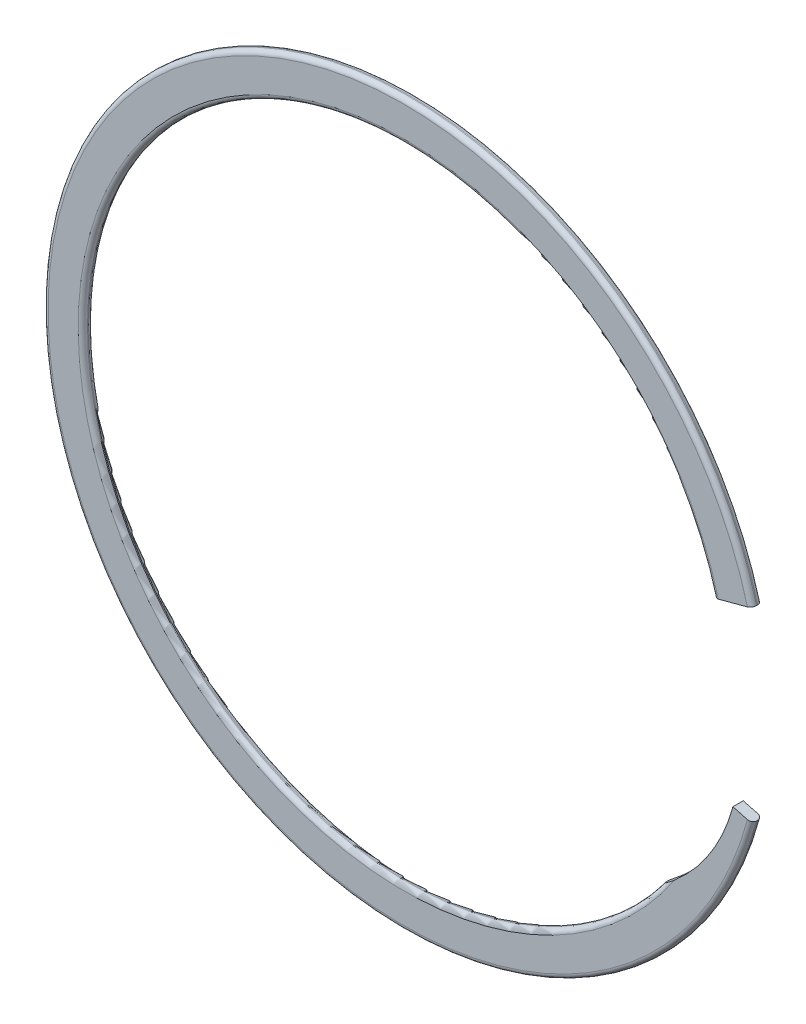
ISO-10303-21;
HEADER;
FILE_DESCRIPTION(('STEP AP214'),'2;1');
FILE_NAME('part.step','',(''),(''),'','','');
FILE_SCHEMA(('AUTOMOTIVE_DESIGN { 1 0 10303 214 1 1 1 1 }'));
ENDSEC;
DATA;
#1=APPLICATION_CONTEXT('core data for automotive mechanical design processes');
#2=APPLICATION_PROTOCOL_DEFINITION('international standard','automotive_design',2000,#1);
#3=PRODUCT_CONTEXT('',#1,'mechanical');
#4=PRODUCT('Part','Part','',(#3));
#5=PRODUCT_RELATED_PRODUCT_CATEGORY('part','',(#4));
#6=PRODUCT_DEFINITION_FORMATION('','',#4);
#7=PRODUCT_DEFINITION_CONTEXT('part definition',#1,'design');
#8=PRODUCT_DEFINITION('design','',#6,#7);
#9=PRODUCT_DEFINITION_SHAPE('','',#8);
#10=(LENGTH_UNIT() NAMED_UNIT(*) SI_UNIT(.MILLI.,.METRE.));
#11=(NAMED_UNIT(*) PLANE_ANGLE_UNIT() SI_UNIT($,.RADIAN.));
#12=(NAMED_UNIT(*) SI_UNIT($,.STERADIAN.) SOLID_ANGLE_UNIT());
#13=UNCERTAINTY_MEASURE_WITH_UNIT(LENGTH_MEASURE(1.E-05),#10,'distance_accuracy_value','');
#14=(GEOMETRIC_REPRESENTATION_CONTEXT(3) GLOBAL_UNCERTAINTY_ASSIGNED_CONTEXT((#13)) GLOBAL_UNIT_ASSIGNED_CONTEXT((#10,
#11,#12)) REPRESENTATION_CONTEXT('',''));
#15=CARTESIAN_POINT('',(0.,0.,0.));
#16=DIRECTION('',(0.,0.,1.));
#17=DIRECTION('',(1.,0.,0.));
#18=AXIS2_PLACEMENT_3D('',#15,#16,#17);
#19=CARTESIAN_POINT('',(0.,0.,0.3937));
#20=DIRECTION('',(0.,0.,-1.));
#21=DIRECTION('',(-1.,0.,0.));
#22=AXIS2_PLACEMENT_3D('',#19,#20,#21);
#23=CYLINDRICAL_SURFACE('',#22,24.4094);
#24=DIRECTION('',(0.,0.,-1.));
#25=VECTOR('',#24,1.);
#26=CARTESIAN_POINT('',(19.6264879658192,-14.512745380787,0.3937));
#27=LINE('',#26,#25);
#28=CARTESIAN_POINT('',(19.6264879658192,-14.512745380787,0.0393699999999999));
#29=VERTEX_POINT('',#28);
#30=CARTESIAN_POINT('',(19.6264879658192,-14.512745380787,-0.0393699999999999));
#31=VERTEX_POINT('',#30);
#32=EDGE_CURVE('E152',#29,#31,#27,.T.);
#33=ORIENTED_EDGE('',*,*,#32,.T.);
#34=CARTESIAN_POINT('',(0.,0.,-0.0393699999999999));
#35=DIRECTION('',(0.,0.,1.));
#36=DIRECTION('',(1.,0.,0.));
#37=AXIS2_PLACEMENT_3D('',#34,#35,#36);
#38=CIRCLE('',#37,24.4094);
#39=CARTESIAN_POINT('',(23.5776698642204,6.31761759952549,-0.0393699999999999));
#40=VERTEX_POINT('',#39);
#41=EDGE_CURVE('E188',#31,#40,#38,.F.);
#42=ORIENTED_EDGE('',*,*,#41,.T.);
#43=DIRECTION('',(0.,0.,-1.));
#44=VECTOR('',#43,1.);
#45=CARTESIAN_POINT('',(23.5776698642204,6.31761759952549,0.3937));
#46=LINE('',#45,#44);
#47=CARTESIAN_POINT('',(23.5776698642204,6.31761759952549,0.0393699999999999));
#48=VERTEX_POINT('',#47);
#49=EDGE_CURVE('E181',#48,#40,#46,.T.);
#50=ORIENTED_EDGE('',*,*,#49,.F.);
#51=CARTESIAN_POINT('',(0.,0.,0.0393699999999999));
#52=DIRECTION('',(0.,0.,1.));
#53=DIRECTION('',(1.,0.,0.));
#54=AXIS2_PLACEMENT_3D('',#51,#52,#53);
#55=CIRCLE('',#54,24.4094);
#56=EDGE_CURVE('E185',#48,#29,#55,.T.);
#57=ORIENTED_EDGE('',*,*,#56,.T.);
#58=EDGE_LOOP('',(#33,#42,#50,#57));
#59=FACE_BOUND('',#58,.T.);
#60=ADVANCED_FACE('F40',(#59),#23,.F.);
#61=CARTESIAN_POINT('',(23.5776698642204,6.31761759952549,0.3937));
#62=DIRECTION('',(-0.258819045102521,0.965925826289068,0.));
#63=DIRECTION('',(-0.965925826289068,-0.258819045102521,0.));
#64=AXIS2_PLACEMENT_3D('',#61,#62,#63);
#65=PLANE('',#64);
#66=ORIENTED_EDGE('',*,*,#49,.T.);
#67=CARTESIAN_POINT('',(23.9199263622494,6.40932495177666,-0.0393699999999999));
#68=DIRECTION('',(-0.258819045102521,0.965925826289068,0.));
#69=DIRECTION('',(-0.965925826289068,-0.258819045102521,0.));
#70=AXIS2_PLACEMENT_3D('',#67,#68,#69);
#71=CIRCLE('',#70,0.35433);
#72=CARTESIAN_POINT('',(23.9199263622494,6.40932495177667,-0.3937));
#73=VERTEX_POINT('',#72);
#74=EDGE_CURVE('E201',#40,#73,#71,.F.);
#75=ORIENTED_EDGE('',*,*,#74,.T.);
#76=DIRECTION('',(0.965925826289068,0.258819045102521,0.));
#77=VECTOR('',#76,1.);
#78=CARTESIAN_POINT('',(23.5776698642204,6.31761759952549,-0.3937));
#79=LINE('',#78,#77);
#80=CARTESIAN_POINT('',(26.130486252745,7.00164268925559,-0.3937));
#81=VERTEX_POINT('',#80);
#82=EDGE_CURVE('E166',#73,#81,#79,.T.);
#83=ORIENTED_EDGE('',*,*,#82,.T.);
#84=CARTESIAN_POINT('',(26.130486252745,7.00164268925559,-0.0393699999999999));
#85=DIRECTION('',(-0.258819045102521,0.965925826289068,0.));
#86=DIRECTION('',(-0.965925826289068,-0.258819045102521,0.));
#87=AXIS2_PLACEMENT_3D('',#84,#85,#86);
#88=CIRCLE('',#87,0.35433);
#89=CARTESIAN_POINT('',(26.472742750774,7.09335004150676,-0.0393699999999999));
#90=VERTEX_POINT('',#89);
#91=EDGE_CURVE('E195',#81,#90,#88,.F.);
#92=ORIENTED_EDGE('',*,*,#91,.T.);
#93=DIRECTION('',(0.,0.,-1.));
#94=VECTOR('',#93,1.);
#95=CARTESIAN_POINT('',(26.472742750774,7.09335004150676,0.3937));
#96=LINE('',#95,#94);
#97=CARTESIAN_POINT('',(26.472742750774,7.09335004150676,0.0393699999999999));
#98=VERTEX_POINT('',#97);
#99=EDGE_CURVE('E177',#98,#90,#96,.T.);
#100=ORIENTED_EDGE('',*,*,#99,.F.);
#101=CARTESIAN_POINT('',(26.130486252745,7.00164268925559,0.0393699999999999));
#102=DIRECTION('',(-0.258819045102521,0.965925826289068,0.));
#103=DIRECTION('',(-0.965925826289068,-0.258819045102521,0.));
#104=AXIS2_PLACEMENT_3D('',#101,#102,#103);
#105=CIRCLE('',#104,0.35433);
#106=CARTESIAN_POINT('',(26.130486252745,7.00164268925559,0.3937));
#107=VERTEX_POINT('',#106);
#108=EDGE_CURVE('E192',#98,#107,#105,.F.);
#109=ORIENTED_EDGE('',*,*,#108,.T.);
#110=DIRECTION('',(0.965925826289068,0.258819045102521,0.));
#111=VECTOR('',#110,1.);
#112=CARTESIAN_POINT('',(23.5776698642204,6.31761759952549,0.3937));
#113=LINE('',#112,#111);
#114=CARTESIAN_POINT('',(23.9199263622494,6.40932495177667,0.3937));
#115=VERTEX_POINT('',#114);
#116=EDGE_CURVE('E140',#115,#107,#113,.T.);
#117=ORIENTED_EDGE('',*,*,#116,.F.);
#118=CARTESIAN_POINT('',(23.9199263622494,6.40932495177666,0.0393699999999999));
#119=DIRECTION('',(-0.258819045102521,0.965925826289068,0.));
#120=DIRECTION('',(-0.965925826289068,-0.258819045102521,0.));
#121=AXIS2_PLACEMENT_3D('',#118,#119,#120);
#122=CIRCLE('',#121,0.35433);
#123=EDGE_CURVE('E198',#115,#48,#122,.F.);
#124=ORIENTED_EDGE('',*,*,#123,.T.);
#125=EDGE_LOOP('',(#66,#75,#83,#92,#100,#109,#117,#124));
#126=FACE_BOUND('',#125,.T.);
#127=ADVANCED_FACE('F237',(#126),#65,.F.);
#128=CARTESIAN_POINT('',(0.,0.,0.3937));
#129=DIRECTION('',(0.,0.,-1.));
#130=DIRECTION('',(-1.,0.,0.));
#131=AXIS2_PLACEMENT_3D('',#128,#129,#130);
#132=CYLINDRICAL_SURFACE('',#131,27.4066);
#133=ORIENTED_EDGE('',*,*,#99,.T.);
#134=CARTESIAN_POINT('',(0.,0.,-0.0393699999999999));
#135=DIRECTION('',(0.,0.,1.));
#136=DIRECTION('',(1.,0.,0.));
#137=AXIS2_PLACEMENT_3D('',#134,#135,#136);
#138=CIRCLE('',#137,27.4066);
#139=CARTESIAN_POINT('',(26.472742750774,-7.09335004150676,-0.0393699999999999));
#140=VERTEX_POINT('',#139);
#141=EDGE_CURVE('E267',#90,#140,#138,.T.);
#142=ORIENTED_EDGE('',*,*,#141,.T.);
#143=DIRECTION('',(0.,0.,-1.));
#144=VECTOR('',#143,1.);
#145=CARTESIAN_POINT('',(26.472742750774,-7.09335004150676,0.3937));
#146=LINE('',#145,#144);
#147=CARTESIAN_POINT('',(26.472742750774,-7.09335004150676,0.0393699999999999));
#148=VERTEX_POINT('',#147);
#149=EDGE_CURVE('E151',#148,#140,#146,.T.);
#150=ORIENTED_EDGE('',*,*,#149,.F.);
#151=CARTESIAN_POINT('',(0.,0.,0.0393699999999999));
#152=DIRECTION('',(0.,0.,1.));
#153=DIRECTION('',(1.,0.,0.));
#154=AXIS2_PLACEMENT_3D('',#151,#152,#153);
#155=CIRCLE('',#154,27.4066);
#156=EDGE_CURVE('E262',#148,#98,#155,.F.);
#157=ORIENTED_EDGE('',*,*,#156,.T.);
#158=EDGE_LOOP('',(#133,#142,#150,#157));
#159=FACE_BOUND('',#158,.T.);
#160=ADVANCED_FACE('F234',(#159),#132,.T.);
#161=CARTESIAN_POINT('',(25.0252063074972,-6.70548382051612,0.3937));
#162=DIRECTION('',(-0.258819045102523,-0.965925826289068,0.));
#163=DIRECTION('',(0.965925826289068,-0.258819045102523,0.));
#164=AXIS2_PLACEMENT_3D('',#161,#162,#163);
#165=PLANE('',#164);
#166=ORIENTED_EDGE('',*,*,#149,.T.);
#167=CARTESIAN_POINT('',(26.130486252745,-7.00164268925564,-0.0393699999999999));
#168=DIRECTION('',(-0.258819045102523,-0.965925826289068,0.));
#169=DIRECTION('',(0.965925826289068,-0.258819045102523,0.));
#170=AXIS2_PLACEMENT_3D('',#167,#168,#169);
#171=CIRCLE('',#170,0.35433);
#172=CARTESIAN_POINT('',(26.130486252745,-7.00164268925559,-0.3937));
#173=VERTEX_POINT('',#172);
#174=EDGE_CURVE('E11',#140,#173,#171,.F.);
#175=ORIENTED_EDGE('',*,*,#174,.T.);
#176=DIRECTION('',(-0.965925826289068,0.258819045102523,0.));
#177=VECTOR('',#176,1.);
#178=CARTESIAN_POINT('',(25.0252063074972,-6.70548382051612,-0.3937));
#179=LINE('',#178,#177);
#180=CARTESIAN_POINT('',(25.0252063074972,-6.70548382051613,-0.3937));
#181=VERTEX_POINT('',#180);
#182=EDGE_CURVE('E146',#173,#181,#179,.T.);
#183=ORIENTED_EDGE('',*,*,#182,.T.);
#184=DIRECTION('',(0.,0.,-1.));
#185=VECTOR('',#184,1.);
#186=CARTESIAN_POINT('',(25.0252063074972,-6.70548382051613,0.3937));
#187=LINE('',#186,#185);
#188=CARTESIAN_POINT('',(25.0252063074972,-6.70548382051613,0.3937));
#189=VERTEX_POINT('',#188);
#190=EDGE_CURVE('E143',#189,#181,#187,.T.);
#191=ORIENTED_EDGE('',*,*,#190,.F.);
#192=DIRECTION('',(-0.965925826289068,0.258819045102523,0.));
#193=VECTOR('',#192,1.);
#194=CARTESIAN_POINT('',(25.0252063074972,-6.70548382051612,0.3937));
#195=LINE('',#194,#193);
#196=CARTESIAN_POINT('',(26.130486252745,-7.00164268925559,0.3937));
#197=VERTEX_POINT('',#196);
#198=EDGE_CURVE('E129',#197,#189,#195,.T.);
#199=ORIENTED_EDGE('',*,*,#198,.F.);
#200=CARTESIAN_POINT('',(26.130486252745,-7.00164268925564,0.0393699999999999));
#201=DIRECTION('',(-0.258819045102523,-0.965925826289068,0.));
#202=DIRECTION('',(0.965925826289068,-0.258819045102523,0.));
#203=AXIS2_PLACEMENT_3D('',#200,#201,#202);
#204=CIRCLE('',#203,0.35433);
#205=EDGE_CURVE('E49',#197,#148,#204,.F.);
#206=ORIENTED_EDGE('',*,*,#205,.T.);
#207=EDGE_LOOP('',(#166,#175,#183,#191,#199,#206));
#208=FACE_BOUND('',#207,.T.);
#209=ADVANCED_FACE('F144',(#208),#165,.F.);
#210=CARTESIAN_POINT('',(11.401712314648,-3.05507960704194,0.3937));
#211=DIRECTION('',(0.,0.,-1.));
#212=DIRECTION('',(-1.,0.,0.));
#213=AXIS2_PLACEMENT_3D('',#210,#211,#212);
#214=CYLINDRICAL_SURFACE('',#213,14.1040788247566);
#215=CARTESIAN_POINT('',(11.401712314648,-3.05507960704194,-0.3937));
#216=DIRECTION('',(0.,0.,-1.));
#217=DIRECTION('',(1.,0.,0.));
#218=AXIS2_PLACEMENT_3D('',#215,#216,#217);
#219=CIRCLE('',#218,14.1040788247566);
#220=CARTESIAN_POINT('',(20.5944790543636,-13.7517182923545,-0.3937));
#221=VERTEX_POINT('',#220);
#222=EDGE_CURVE('E172',#181,#221,#219,.T.);
#223=ORIENTED_EDGE('',*,*,#222,.T.);
#224=CARTESIAN_POINT('',(20.5944790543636,-13.7517182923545,-0.3937));
#225=CARTESIAN_POINT('',(20.5495550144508,-13.7903277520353,-0.393673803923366));
#226=CARTESIAN_POINT('',(20.5043764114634,-13.8286611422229,-0.39262416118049));
#227=CARTESIAN_POINT('',(20.413522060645,-13.9047724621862,-0.388171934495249));
#228=CARTESIAN_POINT('',(20.3678455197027,-13.9425491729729,-0.384764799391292));
#229=CARTESIAN_POINT('',(20.2760797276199,-14.0174772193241,-0.37527872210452));
#230=CARTESIAN_POINT('',(20.2299897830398,-14.0546269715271,-0.369193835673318));
#231=CARTESIAN_POINT('',(20.1377019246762,-14.1280644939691,-0.353790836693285));
#232=CARTESIAN_POINT('',(20.0915041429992,-14.1643529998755,-0.344475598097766));
#233=CARTESIAN_POINT('',(20.0205656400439,-14.21937080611,-0.326857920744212));
#234=CARTESIAN_POINT('',(19.9957479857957,-14.2384852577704,-0.320067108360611));
#235=CARTESIAN_POINT('',(19.9462587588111,-14.2763422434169,-0.304963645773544));
#236=CARTESIAN_POINT('',(19.9215872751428,-14.2950845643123,-0.29665015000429));
#237=CARTESIAN_POINT('',(19.8724116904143,-14.3321912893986,-0.278027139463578));
#238=CARTESIAN_POINT('',(19.8479100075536,-14.3505520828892,-0.267703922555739));
#239=CARTESIAN_POINT('',(19.7996005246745,-14.3865143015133,-0.244418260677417));
#240=CARTESIAN_POINT('',(19.7757917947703,-14.4041167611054,-0.231459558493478));
#241=CARTESIAN_POINT('',(19.7410230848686,-14.4296631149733,-0.208895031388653));
#242=CARTESIAN_POINT('',(19.7294865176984,-14.4381113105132,-0.200760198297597));
#243=CARTESIAN_POINT('',(19.7070603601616,-14.4544841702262,-0.183130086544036));
#244=CARTESIAN_POINT('',(19.6961708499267,-14.4624087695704,-0.17363463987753));
#245=CARTESIAN_POINT('',(19.6784213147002,-14.4752903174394,-0.155749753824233));
#246=CARTESIAN_POINT('',(19.6712849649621,-14.4804582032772,-0.147791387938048));
#247=CARTESIAN_POINT('',(19.6579608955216,-14.4900901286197,-0.130720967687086));
#248=CARTESIAN_POINT('',(19.6517711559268,-14.4945556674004,-0.121611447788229));
#249=CARTESIAN_POINT('',(19.6430084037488,-14.5008690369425,-0.105805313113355));
#250=CARTESIAN_POINT('',(19.6399571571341,-14.5030651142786,-0.0995167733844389));
#251=CARTESIAN_POINT('',(19.6346570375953,-14.5068773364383,-0.0864593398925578));
#252=CARTESIAN_POINT('',(19.6324052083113,-14.508495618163,-0.0796923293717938));
#253=CARTESIAN_POINT('',(19.6293138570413,-14.5107164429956,-0.067356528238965));
#254=CARTESIAN_POINT('',(19.6282693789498,-14.5114664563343,-0.0618663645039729));
#255=CARTESIAN_POINT('',(19.6268493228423,-14.5124859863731,-0.0507122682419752));
#256=CARTESIAN_POINT('',(19.6264792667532,-14.5127515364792,-0.0450472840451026));
#257=CARTESIAN_POINT('',(19.6264879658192,-14.512745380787,-0.0393699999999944));
#258=B_SPLINE_CURVE_WITH_KNOTS('',3,(#224,#225,#226,#227,#228,#229,#230,#231,#232,#233,#234,
#235,#236,#237,#238,#239,#240,#241,#242,#243,#244,#245,#246,#247,#248,#249,#250,#251,#252,#253,
#254,#255,#256,#257),.UNSPECIFIED.,.F.,.F.,(4,2,2,2,2,2,2,2,2,2,2,2,2,2,2,2,4),(0.,
0.177717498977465,0.35577904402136,0.534237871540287,0.712538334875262,0.808669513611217,
0.904854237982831,1.00171928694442,1.09844772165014,1.14775318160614,1.19706473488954,
1.2326123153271,1.26808295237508,1.28999984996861,1.31183483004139,1.32869091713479,
1.34568440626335),.UNSPECIFIED.);
#259=EDGE_CURVE('E217',#221,#31,#258,.T.);
#260=ORIENTED_EDGE('',*,*,#259,.T.);
#261=ORIENTED_EDGE('',*,*,#32,.F.);
#262=CARTESIAN_POINT('',(19.6264879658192,-14.512745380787,0.0393699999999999));
#263=CARTESIAN_POINT('',(19.6264689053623,-14.5127588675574,0.0465216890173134));
#264=CARTESIAN_POINT('',(19.627060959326,-14.5123340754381,0.0536396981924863));
#265=CARTESIAN_POINT('',(19.6292845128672,-14.5107375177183,0.0675269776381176));
#266=CARTESIAN_POINT('',(19.6309013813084,-14.5095762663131,0.0742997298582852));
#267=CARTESIAN_POINT('',(19.6355052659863,-14.5062674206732,0.0890405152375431));
#268=CARTESIAN_POINT('',(19.6387315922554,-14.5039473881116,0.0968923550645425));
#269=CARTESIAN_POINT('',(19.6461591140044,-14.4985999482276,0.111892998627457));
#270=CARTESIAN_POINT('',(19.6503658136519,-14.4955685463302,0.119037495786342));
#271=CARTESIAN_POINT('',(19.6627625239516,-14.4866228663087,0.137600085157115));
#272=CARTESIAN_POINT('',(19.6716179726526,-14.4802199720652,0.148328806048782));
#273=CARTESIAN_POINT('',(19.6904073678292,-14.4665961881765,0.168164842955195));
#274=CARTESIAN_POINT('',(19.7003436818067,-14.459373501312,0.177268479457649));
#275=CARTESIAN_POINT('',(19.7254542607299,-14.4410664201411,0.198049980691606));
#276=CARTESIAN_POINT('',(19.7409788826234,-14.4297030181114,0.209050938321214));
#277=CARTESIAN_POINT('',(19.7727391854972,-14.4063500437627,0.229237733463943));
#278=CARTESIAN_POINT('',(19.7889763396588,-14.3943591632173,0.238419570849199));
#279=CARTESIAN_POINT('',(19.8220349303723,-14.3698325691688,0.25549214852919));
#280=CARTESIAN_POINT('',(19.8388608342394,-14.3572923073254,0.263367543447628));
#281=CARTESIAN_POINT('',(19.8727407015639,-14.331921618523,0.277992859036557));
#282=CARTESIAN_POINT('',(19.8897943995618,-14.3190915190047,0.284743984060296));
#283=CARTESIAN_POINT('',(19.9365959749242,-14.2837118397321,0.301951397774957));
#284=CARTESIAN_POINT('',(19.9664962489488,-14.2609237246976,0.311501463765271));
#285=CARTESIAN_POINT('',(20.0264829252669,-14.2148200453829,0.328545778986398));
#286=CARTESIAN_POINT('',(20.0565694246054,-14.1915041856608,0.336038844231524));
#287=CARTESIAN_POINT('',(20.1470558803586,-14.1207864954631,0.356085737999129));
#288=CARTESIAN_POINT('',(20.2075093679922,-14.0727455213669,0.366149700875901));
#289=CARTESIAN_POINT('',(20.3228867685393,-13.9794892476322,0.380776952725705));
#290=CARTESIAN_POINT('',(20.3778482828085,-13.9343759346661,0.385731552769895));
#291=CARTESIAN_POINT('',(20.459669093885,-13.8661714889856,0.390572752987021));
#292=CARTESIAN_POINT('',(20.4867462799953,-13.8434273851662,0.391755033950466));
#293=CARTESIAN_POINT('',(20.5407376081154,-13.7977286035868,0.393317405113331));
#294=CARTESIAN_POINT('',(20.5676517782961,-13.7747739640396,0.39369763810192));
#295=CARTESIAN_POINT('',(20.5944790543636,-13.7517182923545,0.3937));
#296=B_SPLINE_CURVE_WITH_KNOTS('',3,(#262,#263,#264,#265,#266,#267,#268,#269,#270,#271,#272,
#273,#274,#275,#276,#277,#278,#279,#280,#281,#282,#283,#284,#285,#286,#287,#288,#289,#290,#291,
#292,#293,#294,#295),.UNSPECIFIED.,.F.,.F.,(4,2,2,2,2,2,2,2,2,2,2,2,2,2,2,2,4),(0.,
0.0213640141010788,0.0424296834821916,0.068681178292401,0.0950837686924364,0.140767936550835,
0.186554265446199,0.252877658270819,0.319345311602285,0.386545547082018,0.453673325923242,
0.569949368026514,0.686292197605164,0.919649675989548,1.13338884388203,1.23952477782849,
1.34564181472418),.UNSPECIFIED.);
#297=CARTESIAN_POINT('',(20.5944790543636,-13.7517182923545,0.3937));
#298=VERTEX_POINT('',#297);
#299=EDGE_CURVE('E157',#29,#298,#296,.T.);
#300=ORIENTED_EDGE('',*,*,#299,.T.);
#301=CARTESIAN_POINT('',(11.401712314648,-3.05507960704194,0.3937));
#302=DIRECTION('',(0.,0.,-1.));
#303=DIRECTION('',(1.,0.,0.));
#304=AXIS2_PLACEMENT_3D('',#301,#302,#303);
#305=CIRCLE('',#304,14.1040788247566);
#306=EDGE_CURVE('E134',#189,#298,#305,.T.);
#307=ORIENTED_EDGE('',*,*,#306,.F.);
#308=ORIENTED_EDGE('',*,*,#190,.T.);
#309=EDGE_LOOP('',(#223,#260,#261,#300,#307,#308));
#310=FACE_BOUND('',#309,.T.);
#311=ADVANCED_FACE('F154',(#310),#214,.F.);
#312=CARTESIAN_POINT('',(0.,0.,0.3937));
#313=DIRECTION('',(0.,0.,1.));
#314=DIRECTION('',(1.,0.,0.));
#315=AXIS2_PLACEMENT_3D('',#312,#313,#314);
#316=PLANE('',#315);
#317=ORIENTED_EDGE('',*,*,#306,.T.);
#318=CARTESIAN_POINT('',(0.,0.,0.3937));
#319=DIRECTION('',(0.,0.,1.));
#320=DIRECTION('',(1.,0.,0.));
#321=AXIS2_PLACEMENT_3D('',#318,#319,#320);
#322=CIRCLE('',#321,24.76373);
#323=EDGE_CURVE('E259',#298,#115,#322,.F.);
#324=ORIENTED_EDGE('',*,*,#323,.T.);
#325=ORIENTED_EDGE('',*,*,#116,.T.);
#326=CARTESIAN_POINT('',(0.,0.,0.3937));
#327=DIRECTION('',(0.,0.,1.));
#328=DIRECTION('',(1.,0.,0.));
#329=AXIS2_PLACEMENT_3D('',#326,#327,#328);
#330=CIRCLE('',#329,27.05227);
#331=EDGE_CURVE('E138',#107,#197,#330,.T.);
#332=ORIENTED_EDGE('',*,*,#331,.T.);
#333=ORIENTED_EDGE('',*,*,#198,.T.);
#334=EDGE_LOOP('',(#317,#324,#325,#332,#333));
#335=FACE_BOUND('',#334,.T.);
#336=ADVANCED_FACE('F131',(#335),#316,.T.);
#337=CARTESIAN_POINT('',(0.,0.,-0.3937));
#338=DIRECTION('',(0.,0.,1.));
#339=DIRECTION('',(1.,0.,0.));
#340=AXIS2_PLACEMENT_3D('',#337,#338,#339);
#341=PLANE('',#340);
#342=ORIENTED_EDGE('',*,*,#82,.F.);
#343=CARTESIAN_POINT('',(0.,0.,-0.3937));
#344=DIRECTION('',(0.,0.,1.));
#345=DIRECTION('',(1.,0.,0.));
#346=AXIS2_PLACEMENT_3D('',#343,#344,#345);
#347=CIRCLE('',#346,24.76373);
#348=EDGE_CURVE('E207',#73,#221,#347,.T.);
#349=ORIENTED_EDGE('',*,*,#348,.T.);
#350=ORIENTED_EDGE('',*,*,#222,.F.);
#351=ORIENTED_EDGE('',*,*,#182,.F.);
#352=CARTESIAN_POINT('',(0.,0.,-0.3937));
#353=DIRECTION('',(0.,0.,1.));
#354=DIRECTION('',(1.,0.,0.));
#355=AXIS2_PLACEMENT_3D('',#352,#353,#354);
#356=CIRCLE('',#355,27.05227);
#357=EDGE_CURVE('E204',#173,#81,#356,.F.);
#358=ORIENTED_EDGE('',*,*,#357,.T.);
#359=EDGE_LOOP('',(#342,#349,#350,#351,#358));
#360=FACE_BOUND('',#359,.T.);
#361=ADVANCED_FACE('F229',(#360),#341,.F.);
#362=CARTESIAN_POINT('',(0.,0.,-0.0393699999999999));
#363=DIRECTION('',(0.,0.,1.));
#364=DIRECTION('',(1.,0.,0.));
#365=AXIS2_PLACEMENT_3D('',#362,#363,#364);
#366=TOROIDAL_SURFACE('',#365,24.76373,0.35433);
#367=ORIENTED_EDGE('',*,*,#259,.F.);
#368=ORIENTED_EDGE('',*,*,#348,.F.);
#369=ORIENTED_EDGE('',*,*,#74,.F.);
#370=ORIENTED_EDGE('',*,*,#41,.F.);
#371=EDGE_LOOP('',(#367,#368,#369,#370));
#372=FACE_BOUND('',#371,.T.);
#373=ADVANCED_FACE('F244',(#372),#366,.T.);
#374=CARTESIAN_POINT('',(0.,0.,0.0393699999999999));
#375=DIRECTION('',(0.,0.,1.));
#376=DIRECTION('',(1.,0.,0.));
#377=AXIS2_PLACEMENT_3D('',#374,#375,#376);
#378=TOROIDAL_SURFACE('',#377,24.76373,0.35433);
#379=ORIENTED_EDGE('',*,*,#299,.F.);
#380=ORIENTED_EDGE('',*,*,#56,.F.);
#381=ORIENTED_EDGE('',*,*,#123,.F.);
#382=ORIENTED_EDGE('',*,*,#323,.F.);
#383=EDGE_LOOP('',(#379,#380,#381,#382));
#384=FACE_BOUND('',#383,.T.);
#385=ADVANCED_FACE('F223',(#384),#378,.T.);
#386=CARTESIAN_POINT('',(0.,0.,-0.0393699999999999));
#387=DIRECTION('',(0.,0.,1.));
#388=DIRECTION('',(1.,0.,0.));
#389=AXIS2_PLACEMENT_3D('',#386,#387,#388);
#390=TOROIDAL_SURFACE('',#389,27.05227,0.35433);
#391=ORIENTED_EDGE('',*,*,#91,.F.);
#392=ORIENTED_EDGE('',*,*,#357,.F.);
#393=ORIENTED_EDGE('',*,*,#174,.F.);
#394=ORIENTED_EDGE('',*,*,#141,.F.);
#395=EDGE_LOOP('',(#391,#392,#393,#394));
#396=FACE_BOUND('',#395,.T.);
#397=ADVANCED_FACE('F252',(#396),#390,.T.);
#398=CARTESIAN_POINT('',(0.,0.,0.0393699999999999));
#399=DIRECTION('',(0.,0.,1.));
#400=DIRECTION('',(1.,0.,0.));
#401=AXIS2_PLACEMENT_3D('',#398,#399,#400);
#402=TOROIDAL_SURFACE('',#401,27.05227,0.35433);
#403=ORIENTED_EDGE('',*,*,#108,.F.);
#404=ORIENTED_EDGE('',*,*,#156,.F.);
#405=ORIENTED_EDGE('',*,*,#205,.F.);
#406=ORIENTED_EDGE('',*,*,#331,.F.);
#407=EDGE_LOOP('',(#403,#404,#405,#406));
#408=FACE_BOUND('',#407,.T.);
#409=ADVANCED_FACE('F42',(#408),#402,.T.);
#410=CLOSED_SHELL('',(#60,#127,#160,#209,#311,#336,#361,#373,#385,#397,#409));
#411=MANIFOLD_SOLID_BREP('B2',#410);
#412=ADVANCED_BREP_SHAPE_REPRESENTATION('',(#18,#411),#14);
#413=SHAPE_DEFINITION_REPRESENTATION(#9,#412);
ENDSEC;
END-ISO-10303-21;
